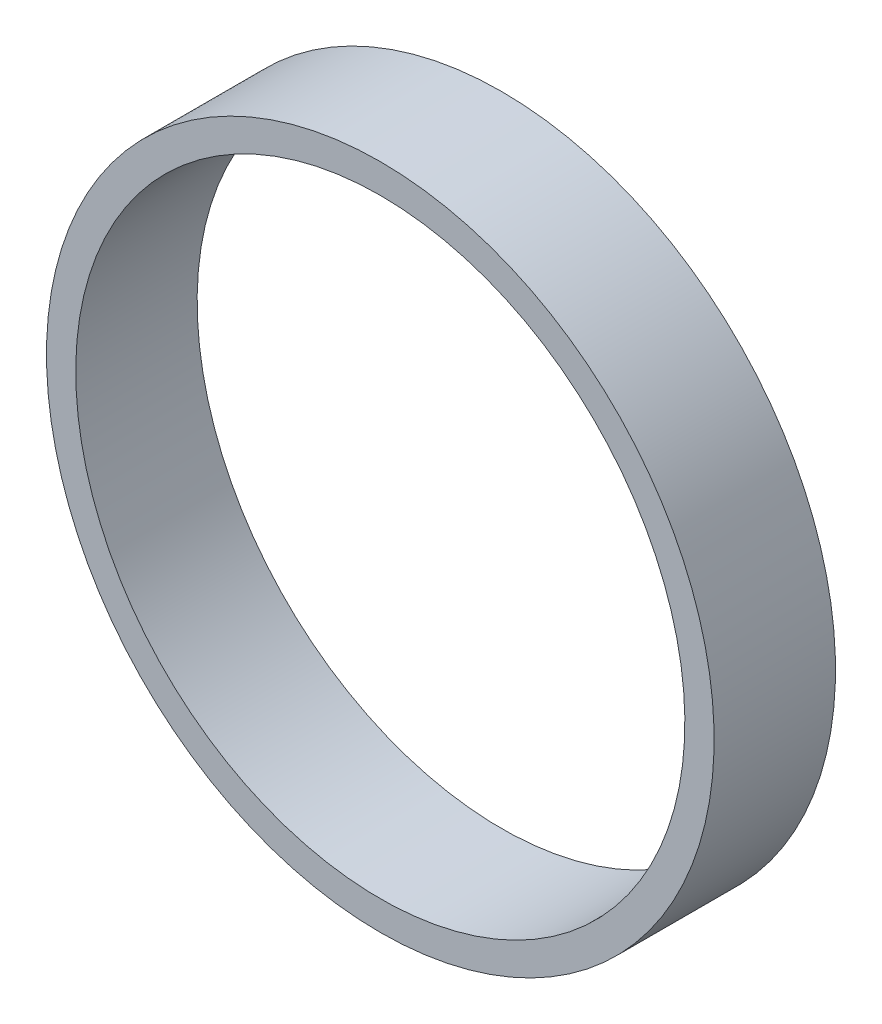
ISO-10303-21;
HEADER;
FILE_DESCRIPTION(('STEP AP214'),'2;1');
FILE_NAME('part.step','',(''),(''),'','','');
FILE_SCHEMA(('AUTOMOTIVE_DESIGN { 1 0 10303 214 1 1 1 1 }'));
ENDSEC;
DATA;
#1=APPLICATION_CONTEXT('core data for automotive mechanical design processes');
#2=APPLICATION_PROTOCOL_DEFINITION('international standard','automotive_design',2000,#1);
#3=PRODUCT_CONTEXT('',#1,'mechanical');
#4=PRODUCT('Part','Part','',(#3));
#5=PRODUCT_RELATED_PRODUCT_CATEGORY('part','',(#4));
#6=PRODUCT_DEFINITION_FORMATION('','',#4);
#7=PRODUCT_DEFINITION_CONTEXT('part definition',#1,'design');
#8=PRODUCT_DEFINITION('design','',#6,#7);
#9=PRODUCT_DEFINITION_SHAPE('','',#8);
#10=(LENGTH_UNIT() NAMED_UNIT(*) SI_UNIT(.MILLI.,.METRE.));
#11=(NAMED_UNIT(*) PLANE_ANGLE_UNIT() SI_UNIT($,.RADIAN.));
#12=(NAMED_UNIT(*) SI_UNIT($,.STERADIAN.) SOLID_ANGLE_UNIT());
#13=UNCERTAINTY_MEASURE_WITH_UNIT(LENGTH_MEASURE(1.E-05),#10,'distance_accuracy_value','');
#14=(GEOMETRIC_REPRESENTATION_CONTEXT(3) GLOBAL_UNCERTAINTY_ASSIGNED_CONTEXT((#13)) GLOBAL_UNIT_ASSIGNED_CONTEXT((#10,
#11,#12)) REPRESENTATION_CONTEXT('',''));
#15=CARTESIAN_POINT('',(0.,0.,0.));
#16=DIRECTION('',(0.,0.,1.));
#17=DIRECTION('',(1.,0.,0.));
#18=AXIS2_PLACEMENT_3D('',#15,#16,#17);
#19=CARTESIAN_POINT('',(0.,0.,12.7));
#20=DIRECTION('',(0.,0.,-1.));
#21=DIRECTION('',(0.,1.,0.));
#22=AXIS2_PLACEMENT_3D('',#19,#20,#21);
#23=CYLINDRICAL_SURFACE('',#22,34.925);
#24=CARTESIAN_POINT('',(0.,0.,12.7));
#25=DIRECTION('',(0.,0.,-1.));
#26=DIRECTION('',(0.,1.,0.));
#27=AXIS2_PLACEMENT_3D('',#24,#25,#26);
#28=CIRCLE('',#27,34.925);
#29=CARTESIAN_POINT('',(0.,34.925,12.7));
#30=VERTEX_POINT('',#29);
#31=EDGE_CURVE('E16',#30,#30,#28,.F.);
#32=ORIENTED_EDGE('',*,*,#31,.F.);
#33=EDGE_LOOP('',(#32));
#34=FACE_BOUND('',#33,.T.);
#35=CARTESIAN_POINT('',(0.,0.,0.));
#36=DIRECTION('',(0.,0.,-1.));
#37=DIRECTION('',(0.,1.,0.));
#38=AXIS2_PLACEMENT_3D('',#35,#36,#37);
#39=CIRCLE('',#38,34.925);
#40=CARTESIAN_POINT('',(0.,34.925,0.));
#41=VERTEX_POINT('',#40);
#42=EDGE_CURVE('E25',#41,#41,#39,.F.);
#43=ORIENTED_EDGE('',*,*,#42,.T.);
#44=EDGE_LOOP('',(#43));
#45=FACE_BOUND('',#44,.T.);
#46=ADVANCED_FACE('F12',(#34,#45),#23,.T.);
#47=CARTESIAN_POINT('',(-35.3441,35.3441,12.7));
#48=DIRECTION('',(0.,0.,1.));
#49=DIRECTION('',(0.,-1.,0.));
#50=AXIS2_PLACEMENT_3D('',#47,#48,#49);
#51=PLANE('',#50);
#52=CARTESIAN_POINT('',(0.,0.,12.7));
#53=DIRECTION('',(0.,0.,-1.));
#54=DIRECTION('',(0.,1.,0.));
#55=AXIS2_PLACEMENT_3D('',#52,#53,#54);
#56=CIRCLE('',#55,31.8643);
#57=CARTESIAN_POINT('',(0.,31.8643,12.7));
#58=VERTEX_POINT('',#57);
#59=EDGE_CURVE('E20',#58,#58,#56,.F.);
#60=ORIENTED_EDGE('',*,*,#59,.F.);
#61=EDGE_LOOP('',(#60));
#62=FACE_BOUND('',#61,.T.);
#63=ORIENTED_EDGE('',*,*,#31,.T.);
#64=EDGE_LOOP('',(#63));
#65=FACE_BOUND('',#64,.T.);
#66=ADVANCED_FACE('F33',(#62,#65),#51,.T.);
#67=CARTESIAN_POINT('',(-35.3441,35.3441,0.));
#68=DIRECTION('',(0.,0.,1.));
#69=DIRECTION('',(0.,-1.,0.));
#70=AXIS2_PLACEMENT_3D('',#67,#68,#69);
#71=PLANE('',#70);
#72=CARTESIAN_POINT('',(0.,0.,0.));
#73=DIRECTION('',(0.,0.,-1.));
#74=DIRECTION('',(0.,1.,0.));
#75=AXIS2_PLACEMENT_3D('',#72,#73,#74);
#76=CIRCLE('',#75,31.8643);
#77=CARTESIAN_POINT('',(0.,31.8643,0.));
#78=VERTEX_POINT('',#77);
#79=EDGE_CURVE('E8',#78,#78,#76,.T.);
#80=ORIENTED_EDGE('',*,*,#79,.F.);
#81=EDGE_LOOP('',(#80));
#82=FACE_BOUND('',#81,.T.);
#83=ORIENTED_EDGE('',*,*,#42,.F.);
#84=EDGE_LOOP('',(#83));
#85=FACE_BOUND('',#84,.T.);
#86=ADVANCED_FACE('F14',(#82,#85),#71,.F.);
#87=CARTESIAN_POINT('',(0.,0.,12.7));
#88=DIRECTION('',(0.,0.,-1.));
#89=DIRECTION('',(0.,1.,0.));
#90=AXIS2_PLACEMENT_3D('',#87,#88,#89);
#91=CYLINDRICAL_SURFACE('',#90,31.8643);
#92=ORIENTED_EDGE('',*,*,#79,.T.);
#93=EDGE_LOOP('',(#92));
#94=FACE_BOUND('',#93,.T.);
#95=ORIENTED_EDGE('',*,*,#59,.T.);
#96=EDGE_LOOP('',(#95));
#97=FACE_BOUND('',#96,.T.);
#98=ADVANCED_FACE('F44',(#94,#97),#91,.F.);
#99=CLOSED_SHELL('',(#46,#66,#86,#98));
#100=MANIFOLD_SOLID_BREP('B1',#99);
#101=ADVANCED_BREP_SHAPE_REPRESENTATION('',(#18,#100),#14);
#102=SHAPE_DEFINITION_REPRESENTATION(#9,#101);
ENDSEC;
END-ISO-10303-21;
